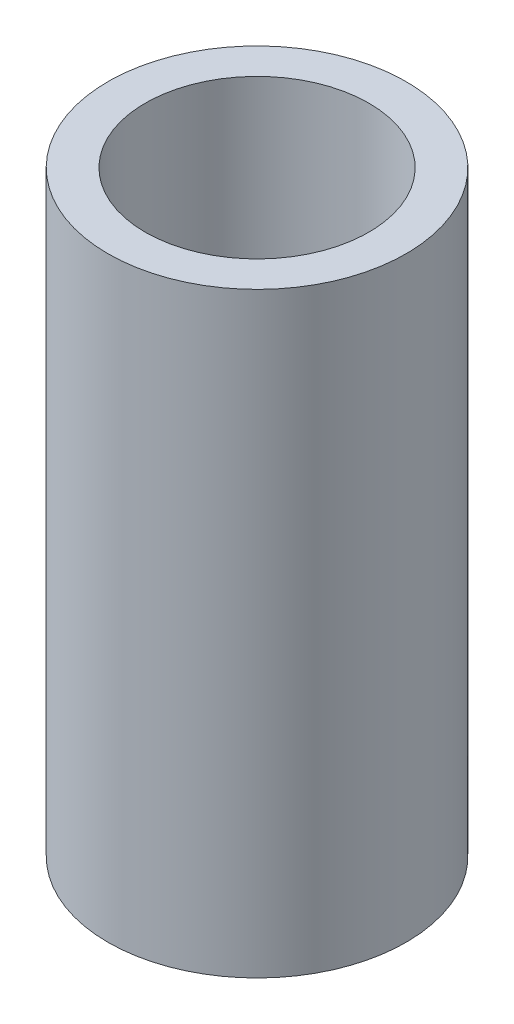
ISO-10303-21;
HEADER;
FILE_DESCRIPTION(('STEP AP214'),'2;1');
FILE_NAME('part.step','',(''),(''),'','','');
FILE_SCHEMA(('AUTOMOTIVE_DESIGN { 1 0 10303 214 1 1 1 1 }'));
ENDSEC;
DATA;
#1=APPLICATION_CONTEXT('core data for automotive mechanical design processes');
#2=APPLICATION_PROTOCOL_DEFINITION('international standard','automotive_design',2000,#1);
#3=PRODUCT_CONTEXT('',#1,'mechanical');
#4=PRODUCT('Part','Part','',(#3));
#5=PRODUCT_RELATED_PRODUCT_CATEGORY('part','',(#4));
#6=PRODUCT_DEFINITION_FORMATION('','',#4);
#7=PRODUCT_DEFINITION_CONTEXT('part definition',#1,'design');
#8=PRODUCT_DEFINITION('design','',#6,#7);
#9=PRODUCT_DEFINITION_SHAPE('','',#8);
#10=(LENGTH_UNIT() NAMED_UNIT(*) SI_UNIT(.MILLI.,.METRE.));
#11=(NAMED_UNIT(*) PLANE_ANGLE_UNIT() SI_UNIT($,.RADIAN.));
#12=(NAMED_UNIT(*) SI_UNIT($,.STERADIAN.) SOLID_ANGLE_UNIT());
#13=UNCERTAINTY_MEASURE_WITH_UNIT(LENGTH_MEASURE(1.E-05),#10,'distance_accuracy_value','');
#14=(GEOMETRIC_REPRESENTATION_CONTEXT(3) GLOBAL_UNCERTAINTY_ASSIGNED_CONTEXT((#13)) GLOBAL_UNIT_ASSIGNED_CONTEXT((#10,
#11,#12)) REPRESENTATION_CONTEXT('',''));
#15=CARTESIAN_POINT('',(0.,0.,0.));
#16=DIRECTION('',(0.,0.,1.));
#17=DIRECTION('',(1.,0.,0.));
#18=AXIS2_PLACEMENT_3D('',#15,#16,#17);
#19=CARTESIAN_POINT('',(0.,0.,0.));
#20=DIRECTION('',(0.,1.,0.));
#21=DIRECTION('',(0.,0.,1.));
#22=AXIS2_PLACEMENT_3D('',#19,#20,#21);
#23=CYLINDRICAL_SURFACE('',#22,6.35);
#24=CARTESIAN_POINT('',(0.,25.4,0.));
#25=DIRECTION('',(0.,1.,0.));
#26=DIRECTION('',(0.,0.,1.));
#27=AXIS2_PLACEMENT_3D('',#24,#25,#26);
#28=CIRCLE('',#27,6.35);
#29=CARTESIAN_POINT('',(0.,25.4,6.35));
#30=VERTEX_POINT('',#29);
#31=EDGE_CURVE('E63',#30,#30,#28,.T.);
#32=ORIENTED_EDGE('',*,*,#31,.F.);
#33=EDGE_LOOP('',(#32));
#34=FACE_BOUND('',#33,.T.);
#35=CARTESIAN_POINT('',(0.,0.,0.));
#36=DIRECTION('',(0.,1.,0.));
#37=DIRECTION('',(0.,0.,1.));
#38=AXIS2_PLACEMENT_3D('',#35,#36,#37);
#39=CIRCLE('',#38,6.35);
#40=CARTESIAN_POINT('',(0.,0.,6.35));
#41=VERTEX_POINT('',#40);
#42=EDGE_CURVE('E48',#41,#41,#39,.T.);
#43=ORIENTED_EDGE('',*,*,#42,.T.);
#44=EDGE_LOOP('',(#43));
#45=FACE_BOUND('',#44,.T.);
#46=ADVANCED_FACE('F45',(#34,#45),#23,.T.);
#47=CARTESIAN_POINT('',(0.,0.,0.));
#48=DIRECTION('',(0.,1.,0.));
#49=DIRECTION('',(0.,0.,1.));
#50=AXIS2_PLACEMENT_3D('',#47,#48,#49);
#51=PLANE('',#50);
#52=CARTESIAN_POINT('',(0.,0.,0.));
#53=DIRECTION('',(0.,1.,0.));
#54=DIRECTION('',(0.,0.,1.));
#55=AXIS2_PLACEMENT_3D('',#52,#53,#54);
#56=CIRCLE('',#55,4.7625);
#57=CARTESIAN_POINT('',(0.,0.,4.7625));
#58=VERTEX_POINT('',#57);
#59=EDGE_CURVE('E53',#58,#58,#56,.F.);
#60=ORIENTED_EDGE('',*,*,#59,.F.);
#61=EDGE_LOOP('',(#60));
#62=FACE_BOUND('',#61,.T.);
#63=ORIENTED_EDGE('',*,*,#42,.F.);
#64=EDGE_LOOP('',(#63));
#65=FACE_BOUND('',#64,.T.);
#66=ADVANCED_FACE('F81',(#62,#65),#51,.F.);
#67=CARTESIAN_POINT('',(0.,25.4,0.));
#68=DIRECTION('',(0.,1.,0.));
#69=DIRECTION('',(0.,0.,1.));
#70=AXIS2_PLACEMENT_3D('',#67,#68,#69);
#71=PLANE('',#70);
#72=CARTESIAN_POINT('',(0.,25.4,0.));
#73=DIRECTION('',(0.,1.,0.));
#74=DIRECTION('',(0.,0.,1.));
#75=AXIS2_PLACEMENT_3D('',#72,#73,#74);
#76=CIRCLE('',#75,4.7625);
#77=CARTESIAN_POINT('',(0.,25.4,4.7625));
#78=VERTEX_POINT('',#77);
#79=EDGE_CURVE('E13',#78,#78,#76,.F.);
#80=ORIENTED_EDGE('',*,*,#79,.T.);
#81=EDGE_LOOP('',(#80));
#82=FACE_BOUND('',#81,.T.);
#83=ORIENTED_EDGE('',*,*,#31,.T.);
#84=EDGE_LOOP('',(#83));
#85=FACE_BOUND('',#84,.T.);
#86=ADVANCED_FACE('F70',(#82,#85),#71,.T.);
#87=CARTESIAN_POINT('',(0.,0.,0.));
#88=DIRECTION('',(0.,1.,0.));
#89=DIRECTION('',(0.,0.,1.));
#90=AXIS2_PLACEMENT_3D('',#87,#88,#89);
#91=CYLINDRICAL_SURFACE('',#90,4.7625);
#92=ORIENTED_EDGE('',*,*,#79,.F.);
#93=EDGE_LOOP('',(#92));
#94=FACE_BOUND('',#93,.T.);
#95=ORIENTED_EDGE('',*,*,#59,.T.);
#96=EDGE_LOOP('',(#95));
#97=FACE_BOUND('',#96,.T.);
#98=ADVANCED_FACE('F73',(#94,#97),#91,.F.);
#99=CLOSED_SHELL('',(#46,#66,#86,#98));
#100=MANIFOLD_SOLID_BREP('B2',#99);
#101=ADVANCED_BREP_SHAPE_REPRESENTATION('',(#18,#100),#14);
#102=SHAPE_DEFINITION_REPRESENTATION(#9,#101);
ENDSEC;
END-ISO-10303-21;
